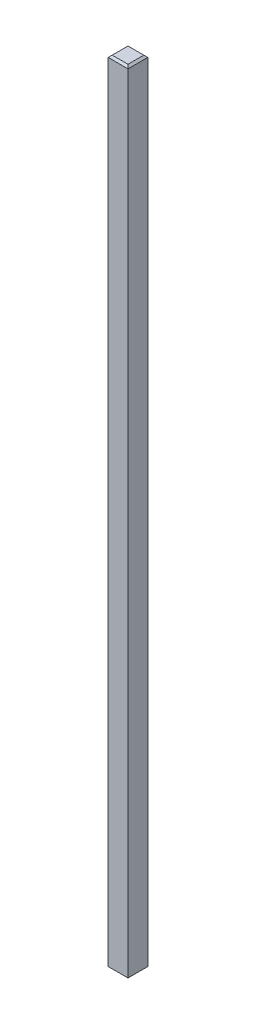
from build123d import *

# Parameters (mm, degrees)
ESQUISSE1_W        = 10
ESQUISSE1_H        = 400
BOSS_EXTRU_1_DEPTH = 10
CHANFREIN1_SIZE    = 1


with BuildPart() as part:
    # Esquisse1 → Boss.-Extru.1 (new body)
    with BuildSketch(Plane.XY):
        with Locations((5, 200)):
            Rectangle(ESQUISSE1_W, ESQUISSE1_H)
    extrude(amount=BOSS_EXTRU_1_DEPTH)

    # Chanfrein1
    chanfrein1_edges = [part.edges().sort_by_distance(p)[0] for p in [
        (5, 400, 10),
        (5, 400, 0),
        (5, 0, 0),
        (0, 400, 5),
        (10, 400, 5),
        (10, 0, 5),
        (0, 0, 5),
        (5, 0, 10),
    ]]
    chamfer(chanfrein1_edges, length=CHANFREIN1_SIZE)


solid = part.part
